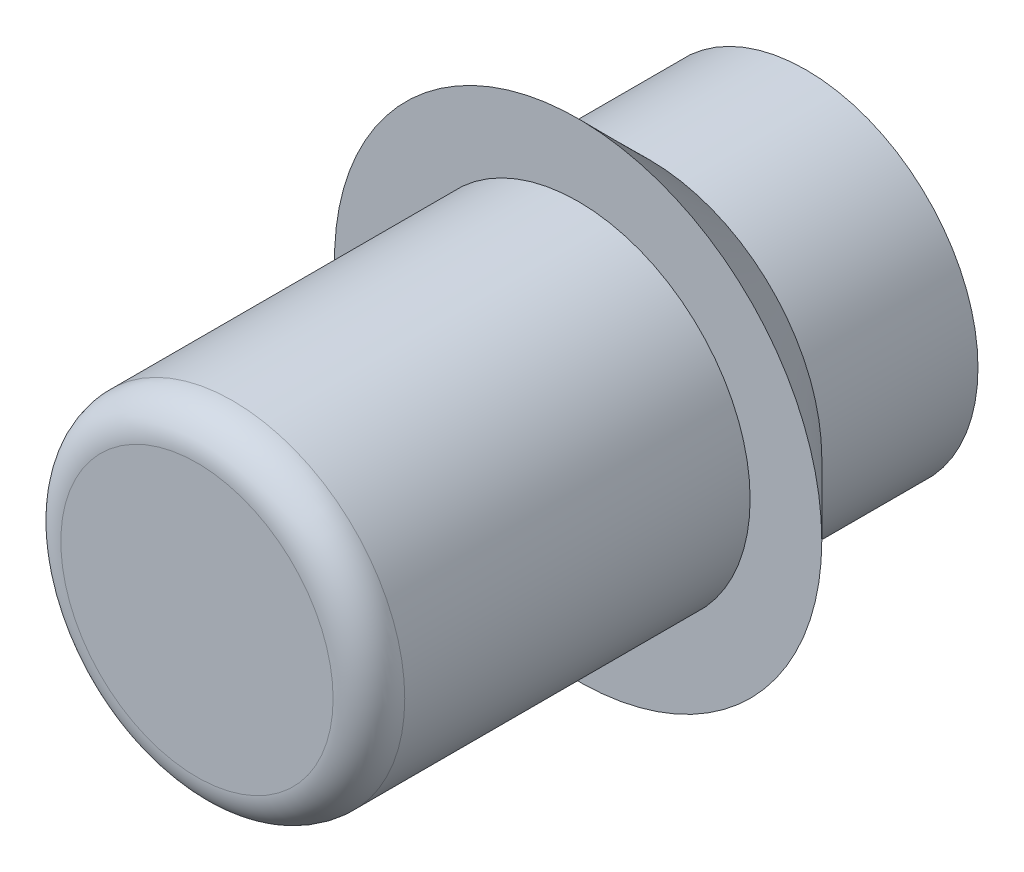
ISO-10303-21;
HEADER;
FILE_DESCRIPTION(('STEP AP214'),'2;1');
FILE_NAME('part.step','',(''),(''),'','','');
FILE_SCHEMA(('AUTOMOTIVE_DESIGN { 1 0 10303 214 1 1 1 1 }'));
ENDSEC;
DATA;
#1=APPLICATION_CONTEXT('core data for automotive mechanical design processes');
#2=APPLICATION_PROTOCOL_DEFINITION('international standard','automotive_design',2000,#1);
#3=PRODUCT_CONTEXT('',#1,'mechanical');
#4=PRODUCT('Part','Part','',(#3));
#5=PRODUCT_RELATED_PRODUCT_CATEGORY('part','',(#4));
#6=PRODUCT_DEFINITION_FORMATION('','',#4);
#7=PRODUCT_DEFINITION_CONTEXT('part definition',#1,'design');
#8=PRODUCT_DEFINITION('design','',#6,#7);
#9=PRODUCT_DEFINITION_SHAPE('','',#8);
#10=(LENGTH_UNIT() NAMED_UNIT(*) SI_UNIT(.MILLI.,.METRE.));
#11=(NAMED_UNIT(*) PLANE_ANGLE_UNIT() SI_UNIT($,.RADIAN.));
#12=(NAMED_UNIT(*) SI_UNIT($,.STERADIAN.) SOLID_ANGLE_UNIT());
#13=UNCERTAINTY_MEASURE_WITH_UNIT(LENGTH_MEASURE(1.E-05),#10,'distance_accuracy_value','');
#14=(GEOMETRIC_REPRESENTATION_CONTEXT(3) GLOBAL_UNCERTAINTY_ASSIGNED_CONTEXT((#13)) GLOBAL_UNIT_ASSIGNED_CONTEXT((#10,
#11,#12)) REPRESENTATION_CONTEXT('',''));
#15=CARTESIAN_POINT('',(0.,0.,0.));
#16=DIRECTION('',(0.,0.,1.));
#17=DIRECTION('',(1.,0.,0.));
#18=AXIS2_PLACEMENT_3D('',#15,#16,#17);
#19=CARTESIAN_POINT('',(0.,0.,8.5));
#20=DIRECTION('',(0.,0.,-1.));
#21=DIRECTION('',(-1.,0.,0.));
#22=AXIS2_PLACEMENT_3D('',#19,#20,#21);
#23=CYLINDRICAL_SURFACE('',#22,2.4);
#24=CARTESIAN_POINT('',(0.,0.,2.18000000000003));
#25=DIRECTION('',(0.,0.,1.));
#26=DIRECTION('',(1.,0.,0.));
#27=AXIS2_PLACEMENT_3D('',#24,#25,#26);
#28=CIRCLE('',#27,2.4);
#29=CARTESIAN_POINT('',(2.4,0.,2.18000000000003));
#30=VERTEX_POINT('',#29);
#31=EDGE_CURVE('E48',#30,#30,#28,.F.);
#32=ORIENTED_EDGE('',*,*,#31,.T.);
#33=EDGE_LOOP('',(#32));
#34=FACE_BOUND('',#33,.T.);
#35=CARTESIAN_POINT('',(0.,0.,0.));
#36=DIRECTION('',(0.,0.,1.));
#37=DIRECTION('',(1.,0.,0.));
#38=AXIS2_PLACEMENT_3D('',#35,#36,#37);
#39=CIRCLE('',#38,2.4);
#40=CARTESIAN_POINT('',(2.4,0.,0.));
#41=VERTEX_POINT('',#40);
#42=EDGE_CURVE('E52',#41,#41,#39,.T.);
#43=ORIENTED_EDGE('',*,*,#42,.T.);
#44=EDGE_LOOP('',(#43));
#45=FACE_BOUND('',#44,.T.);
#46=ADVANCED_FACE('F37',(#34,#45),#23,.T.);
#47=CARTESIAN_POINT('',(0.,0.,0.));
#48=DIRECTION('',(0.,0.,1.));
#49=DIRECTION('',(1.,0.,0.));
#50=AXIS2_PLACEMENT_3D('',#47,#48,#49);
#51=PLANE('',#50);
#52=ORIENTED_EDGE('',*,*,#42,.F.);
#53=EDGE_LOOP('',(#52));
#54=FACE_BOUND('',#53,.T.);
#55=ADVANCED_FACE('F80',(#54),#51,.F.);
#56=CARTESIAN_POINT('',(0.,0.,3.18));
#57=DIRECTION('',(0.,0.,1.));
#58=DIRECTION('',(1.,0.,0.));
#59=AXIS2_PLACEMENT_3D('',#56,#57,#58);
#60=PLANE('',#59);
#61=CARTESIAN_POINT('',(0.,0.,3.18));
#62=DIRECTION('',(0.,0.,1.));
#63=DIRECTION('',(1.,0.,0.));
#64=AXIS2_PLACEMENT_3D('',#61,#62,#63);
#65=CIRCLE('',#64,2.4);
#66=CARTESIAN_POINT('',(2.4,0.,3.18));
#67=VERTEX_POINT('',#66);
#68=EDGE_CURVE('E55',#67,#67,#65,.T.);
#69=ORIENTED_EDGE('',*,*,#68,.F.);
#70=EDGE_LOOP('',(#69));
#71=FACE_BOUND('',#70,.T.);
#72=CARTESIAN_POINT('',(0.,0.,3.18));
#73=DIRECTION('',(0.,0.,1.));
#74=DIRECTION('',(1.,0.,0.));
#75=AXIS2_PLACEMENT_3D('',#72,#73,#74);
#76=CIRCLE('',#75,3.4);
#77=CARTESIAN_POINT('',(3.4,0.,3.18));
#78=VERTEX_POINT('',#77);
#79=EDGE_CURVE('E58',#78,#78,#76,.T.);
#80=ORIENTED_EDGE('',*,*,#79,.T.);
#81=EDGE_LOOP('',(#80));
#82=FACE_BOUND('',#81,.T.);
#83=ADVANCED_FACE('F64',(#71,#82),#60,.T.);
#84=CARTESIAN_POINT('',(0.,0.,8.5));
#85=DIRECTION('',(0.,0.,1.));
#86=DIRECTION('',(1.,0.,0.));
#87=AXIS2_PLACEMENT_3D('',#84,#85,#86);
#88=PLANE('',#87);
#89=CARTESIAN_POINT('',(0.,0.,8.5));
#90=DIRECTION('',(0.,0.,1.));
#91=DIRECTION('',(1.,0.,0.));
#92=AXIS2_PLACEMENT_3D('',#89,#90,#91);
#93=CIRCLE('',#92,1.9);
#94=CARTESIAN_POINT('',(1.9,0.,8.5));
#95=VERTEX_POINT('',#94);
#96=EDGE_CURVE('E44',#95,#95,#93,.T.);
#97=ORIENTED_EDGE('',*,*,#96,.T.);
#98=EDGE_LOOP('',(#97));
#99=FACE_BOUND('',#98,.T.);
#100=ADVANCED_FACE('F75',(#99),#88,.T.);
#101=CARTESIAN_POINT('',(0.,0.,8.));
#102=DIRECTION('',(0.,0.,1.));
#103=DIRECTION('',(1.,0.,0.));
#104=AXIS2_PLACEMENT_3D('',#101,#102,#103);
#105=CIRCLE('',#104,2.4);
#106=CARTESIAN_POINT('',(2.4,0.,8.));
#107=VERTEX_POINT('',#106);
#108=EDGE_CURVE('E10',#107,#107,#105,.F.);
#109=ORIENTED_EDGE('',*,*,#108,.T.);
#110=EDGE_LOOP('',(#109));
#111=FACE_BOUND('',#110,.T.);
#112=ORIENTED_EDGE('',*,*,#68,.T.);
#113=EDGE_LOOP('',(#112));
#114=FACE_BOUND('',#113,.T.);
#115=ADVANCED_FACE('F68',(#111,#114),#23,.T.);
#116=CARTESIAN_POINT('',(0.,0.,3.18000000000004));
#117=DIRECTION('',(0.,0.,1.));
#118=DIRECTION('',(1.,0.,0.));
#119=AXIS2_PLACEMENT_3D('',#116,#117,#118);
#120=CONICAL_SURFACE('',#119,3.4,0.785398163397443);
#121=ORIENTED_EDGE('',*,*,#31,.F.);
#122=EDGE_LOOP('',(#121));
#123=FACE_BOUND('',#122,.T.);
#124=ORIENTED_EDGE('',*,*,#79,.F.);
#125=EDGE_LOOP('',(#124));
#126=FACE_BOUND('',#125,.T.);
#127=ADVANCED_FACE('F66',(#123,#126),#120,.T.);
#128=CARTESIAN_POINT('',(0.,0.,8.));
#129=DIRECTION('',(0.,0.,1.));
#130=DIRECTION('',(1.,0.,0.));
#131=AXIS2_PLACEMENT_3D('',#128,#129,#130);
#132=TOROIDAL_SURFACE('',#131,1.9,0.5);
#133=ORIENTED_EDGE('',*,*,#108,.F.);
#134=EDGE_LOOP('',(#133));
#135=FACE_BOUND('',#134,.T.);
#136=ORIENTED_EDGE('',*,*,#96,.F.);
#137=EDGE_LOOP('',(#136));
#138=FACE_BOUND('',#137,.T.);
#139=ADVANCED_FACE('F39',(#135,#138),#132,.T.);
#140=CLOSED_SHELL('',(#46,#55,#83,#100,#115,#127,#139));
#141=MANIFOLD_SOLID_BREP('B2',#140);
#142=ADVANCED_BREP_SHAPE_REPRESENTATION('',(#18,#141),#14);
#143=SHAPE_DEFINITION_REPRESENTATION(#9,#142);
ENDSEC;
END-ISO-10303-21;
